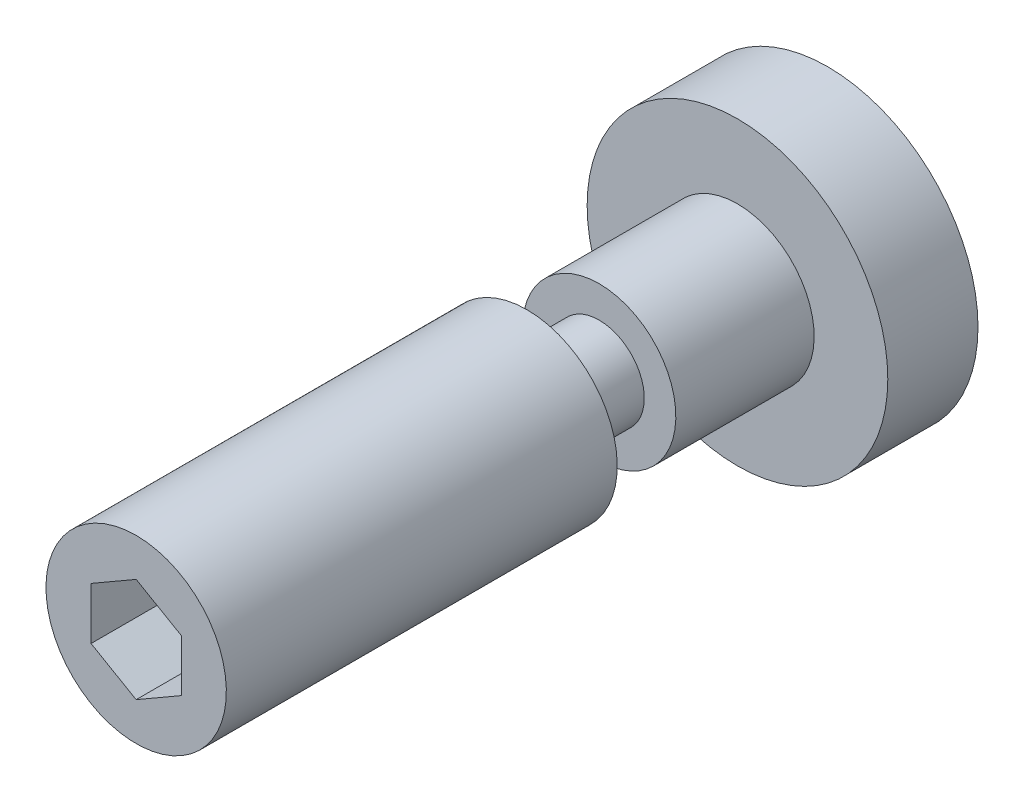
ISO-10303-21;
HEADER;
FILE_DESCRIPTION(('STEP AP214'),'2;1');
FILE_NAME('part.step','',(''),(''),'','','');
FILE_SCHEMA(('AUTOMOTIVE_DESIGN { 1 0 10303 214 1 1 1 1 }'));
ENDSEC;
DATA;
#1=APPLICATION_CONTEXT('core data for automotive mechanical design processes');
#2=APPLICATION_PROTOCOL_DEFINITION('international standard','automotive_design',2000,#1);
#3=PRODUCT_CONTEXT('',#1,'mechanical');
#4=PRODUCT('Part','Part','',(#3));
#5=PRODUCT_RELATED_PRODUCT_CATEGORY('part','',(#4));
#6=PRODUCT_DEFINITION_FORMATION('','',#4);
#7=PRODUCT_DEFINITION_CONTEXT('part definition',#1,'design');
#8=PRODUCT_DEFINITION('design','',#6,#7);
#9=PRODUCT_DEFINITION_SHAPE('','',#8);
#10=(LENGTH_UNIT() NAMED_UNIT(*) SI_UNIT(.MILLI.,.METRE.));
#11=(NAMED_UNIT(*) PLANE_ANGLE_UNIT() SI_UNIT($,.RADIAN.));
#12=(NAMED_UNIT(*) SI_UNIT($,.STERADIAN.) SOLID_ANGLE_UNIT());
#13=UNCERTAINTY_MEASURE_WITH_UNIT(LENGTH_MEASURE(1.E-05),#10,'distance_accuracy_value','');
#14=(GEOMETRIC_REPRESENTATION_CONTEXT(3) GLOBAL_UNCERTAINTY_ASSIGNED_CONTEXT((#13)) GLOBAL_UNIT_ASSIGNED_CONTEXT((#10,
#11,#12)) REPRESENTATION_CONTEXT('',''));
#15=CARTESIAN_POINT('',(0.,0.,0.));
#16=DIRECTION('',(0.,0.,1.));
#17=DIRECTION('',(1.,0.,0.));
#18=AXIS2_PLACEMENT_3D('',#15,#16,#17);
#19=CARTESIAN_POINT('',(0.,0.,0.));
#20=DIRECTION('',(0.,0.,1.));
#21=DIRECTION('',(0.,1.,0.));
#22=AXIS2_PLACEMENT_3D('',#19,#20,#21);
#23=PLANE('',#22);
#24=CARTESIAN_POINT('',(0.,0.,0.));
#25=DIRECTION('',(0.,0.,1.));
#26=DIRECTION('',(0.,1.,0.));
#27=AXIS2_PLACEMENT_3D('',#24,#25,#26);
#28=CIRCLE('',#27,5.);
#29=CARTESIAN_POINT('',(0.,5.,0.));
#30=VERTEX_POINT('',#29);
#31=EDGE_CURVE('E9',#30,#30,#28,.T.);
#32=ORIENTED_EDGE('',*,*,#31,.F.);
#33=EDGE_LOOP('',(#32));
#34=FACE_BOUND('',#33,.T.);
#35=ADVANCED_FACE('F14',(#34),#23,.F.);
#36=CARTESIAN_POINT('',(0.,0.,40.));
#37=DIRECTION('',(0.,0.,1.));
#38=DIRECTION('',(0.,1.,0.));
#39=AXIS2_PLACEMENT_3D('',#36,#37,#38);
#40=CYLINDRICAL_SURFACE('',#39,5.);
#41=CARTESIAN_POINT('',(0.,0.,3.));
#42=DIRECTION('',(0.,0.,1.));
#43=DIRECTION('',(0.,1.,0.));
#44=AXIS2_PLACEMENT_3D('',#41,#42,#43);
#45=CIRCLE('',#44,5.);
#46=CARTESIAN_POINT('',(0.,5.,3.));
#47=VERTEX_POINT('',#46);
#48=EDGE_CURVE('E21',#47,#47,#45,.T.);
#49=ORIENTED_EDGE('',*,*,#48,.F.);
#50=EDGE_LOOP('',(#49));
#51=FACE_BOUND('',#50,.T.);
#52=ORIENTED_EDGE('',*,*,#31,.T.);
#53=EDGE_LOOP('',(#52));
#54=FACE_BOUND('',#53,.T.);
#55=ADVANCED_FACE('F142',(#51,#54),#40,.T.);
#56=CARTESIAN_POINT('',(0.,-5.,3.));
#57=DIRECTION('',(0.,0.,-1.));
#58=DIRECTION('',(0.,-1.,0.));
#59=AXIS2_PLACEMENT_3D('',#56,#57,#58);
#60=PLANE('',#59);
#61=CARTESIAN_POINT('',(0.,0.,3.));
#62=DIRECTION('',(0.,0.,1.));
#63=DIRECTION('',(0.,1.,0.));
#64=AXIS2_PLACEMENT_3D('',#61,#62,#63);
#65=CIRCLE('',#64,2.55);
#66=CARTESIAN_POINT('',(0.,2.55,3.));
#67=VERTEX_POINT('',#66);
#68=EDGE_CURVE('E135',#67,#67,#65,.T.);
#69=ORIENTED_EDGE('',*,*,#68,.F.);
#70=EDGE_LOOP('',(#69));
#71=FACE_BOUND('',#70,.T.);
#72=ORIENTED_EDGE('',*,*,#48,.T.);
#73=EDGE_LOOP('',(#72));
#74=FACE_BOUND('',#73,.T.);
#75=ADVANCED_FACE('F140',(#71,#74),#60,.F.);
#76=CARTESIAN_POINT('',(0.,0.,40.));
#77=DIRECTION('',(0.,0.,1.));
#78=DIRECTION('',(0.,1.,0.));
#79=AXIS2_PLACEMENT_3D('',#76,#77,#78);
#80=CYLINDRICAL_SURFACE('',#79,2.55);
#81=CARTESIAN_POINT('',(0.,0.,7.6));
#82=DIRECTION('',(0.,0.,1.));
#83=DIRECTION('',(0.,1.,0.));
#84=AXIS2_PLACEMENT_3D('',#81,#82,#83);
#85=CIRCLE('',#84,2.55);
#86=CARTESIAN_POINT('',(0.,2.55,7.6));
#87=VERTEX_POINT('',#86);
#88=EDGE_CURVE('E132',#87,#87,#85,.T.);
#89=ORIENTED_EDGE('',*,*,#88,.F.);
#90=EDGE_LOOP('',(#89));
#91=FACE_BOUND('',#90,.T.);
#92=ORIENTED_EDGE('',*,*,#68,.T.);
#93=EDGE_LOOP('',(#92));
#94=FACE_BOUND('',#93,.T.);
#95=ADVANCED_FACE('F165',(#91,#94),#80,.T.);
#96=CARTESIAN_POINT('',(0.,-2.55,7.6));
#97=DIRECTION('',(0.,0.,-1.));
#98=DIRECTION('',(0.,-1.,0.));
#99=AXIS2_PLACEMENT_3D('',#96,#97,#98);
#100=PLANE('',#99);
#101=CARTESIAN_POINT('',(0.,0.,7.6));
#102=DIRECTION('',(0.,0.,1.));
#103=DIRECTION('',(0.,1.,0.));
#104=AXIS2_PLACEMENT_3D('',#101,#102,#103);
#105=CIRCLE('',#104,1.5);
#106=CARTESIAN_POINT('',(0.,1.5,7.6));
#107=VERTEX_POINT('',#106);
#108=EDGE_CURVE('E129',#107,#107,#105,.T.);
#109=ORIENTED_EDGE('',*,*,#108,.F.);
#110=EDGE_LOOP('',(#109));
#111=FACE_BOUND('',#110,.T.);
#112=ORIENTED_EDGE('',*,*,#88,.T.);
#113=EDGE_LOOP('',(#112));
#114=FACE_BOUND('',#113,.T.);
#115=ADVANCED_FACE('F174',(#111,#114),#100,.F.);
#116=CARTESIAN_POINT('',(0.,0.,40.));
#117=DIRECTION('',(0.,0.,1.));
#118=DIRECTION('',(0.,1.,0.));
#119=AXIS2_PLACEMENT_3D('',#116,#117,#118);
#120=CYLINDRICAL_SURFACE('',#119,1.5);
#121=CARTESIAN_POINT('',(0.,0.,10.));
#122=DIRECTION('',(0.,0.,1.));
#123=DIRECTION('',(0.,1.,0.));
#124=AXIS2_PLACEMENT_3D('',#121,#122,#123);
#125=CIRCLE('',#124,1.5);
#126=CARTESIAN_POINT('',(0.,1.5,10.));
#127=VERTEX_POINT('',#126);
#128=EDGE_CURVE('E126',#127,#127,#125,.T.);
#129=ORIENTED_EDGE('',*,*,#128,.F.);
#130=EDGE_LOOP('',(#129));
#131=FACE_BOUND('',#130,.T.);
#132=ORIENTED_EDGE('',*,*,#108,.T.);
#133=EDGE_LOOP('',(#132));
#134=FACE_BOUND('',#133,.T.);
#135=ADVANCED_FACE('F183',(#131,#134),#120,.T.);
#136=CARTESIAN_POINT('',(0.,-1.5,10.));
#137=DIRECTION('',(0.,0.,1.));
#138=DIRECTION('',(0.,1.,0.));
#139=AXIS2_PLACEMENT_3D('',#136,#137,#138);
#140=PLANE('',#139);
#141=CARTESIAN_POINT('',(0.,0.,10.));
#142=DIRECTION('',(0.,0.,1.));
#143=DIRECTION('',(0.,1.,0.));
#144=AXIS2_PLACEMENT_3D('',#141,#142,#143);
#145=CIRCLE('',#144,3.);
#146=CARTESIAN_POINT('',(0.,3.,10.));
#147=VERTEX_POINT('',#146);
#148=EDGE_CURVE('E123',#147,#147,#145,.T.);
#149=ORIENTED_EDGE('',*,*,#148,.F.);
#150=EDGE_LOOP('',(#149));
#151=FACE_BOUND('',#150,.T.);
#152=ORIENTED_EDGE('',*,*,#128,.T.);
#153=EDGE_LOOP('',(#152));
#154=FACE_BOUND('',#153,.T.);
#155=ADVANCED_FACE('F192',(#151,#154),#140,.F.);
#156=CARTESIAN_POINT('',(0.,0.,40.));
#157=DIRECTION('',(0.,0.,1.));
#158=DIRECTION('',(0.,1.,0.));
#159=AXIS2_PLACEMENT_3D('',#156,#157,#158);
#160=CYLINDRICAL_SURFACE('',#159,3.);
#161=CARTESIAN_POINT('',(0.,0.,23.));
#162=DIRECTION('',(0.,0.,1.));
#163=DIRECTION('',(0.,1.,0.));
#164=AXIS2_PLACEMENT_3D('',#161,#162,#163);
#165=CIRCLE('',#164,3.);
#166=CARTESIAN_POINT('',(0.,3.,23.));
#167=VERTEX_POINT('',#166);
#168=EDGE_CURVE('E115',#167,#167,#165,.T.);
#169=ORIENTED_EDGE('',*,*,#168,.F.);
#170=EDGE_LOOP('',(#169));
#171=FACE_BOUND('',#170,.T.);
#172=ORIENTED_EDGE('',*,*,#148,.T.);
#173=EDGE_LOOP('',(#172));
#174=FACE_BOUND('',#173,.T.);
#175=ADVANCED_FACE('F201',(#171,#174),#160,.T.);
#176=CARTESIAN_POINT('',(0.,-3.,23.));
#177=DIRECTION('',(0.,0.,-1.));
#178=DIRECTION('',(0.,-1.,0.));
#179=AXIS2_PLACEMENT_3D('',#176,#177,#178);
#180=PLANE('',#179);
#181=DIRECTION('',(-0.866025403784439,-0.5,0.));
#182=VECTOR('',#181,1.);
#183=CARTESIAN_POINT('',(0.,1.73205080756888,23.));
#184=LINE('',#183,#182);
#185=CARTESIAN_POINT('',(0.,1.73205080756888,23.));
#186=VERTEX_POINT('',#185);
#187=CARTESIAN_POINT('',(-1.5,0.866025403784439,23.));
#188=VERTEX_POINT('',#187);
#189=EDGE_CURVE('E102',#186,#188,#184,.T.);
#190=ORIENTED_EDGE('',*,*,#189,.F.);
#191=DIRECTION('',(-0.866025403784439,0.5,0.));
#192=VECTOR('',#191,1.);
#193=CARTESIAN_POINT('',(1.5,0.86602540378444,23.));
#194=LINE('',#193,#192);
#195=CARTESIAN_POINT('',(1.5,0.86602540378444,23.));
#196=VERTEX_POINT('',#195);
#197=EDGE_CURVE('E28',#196,#186,#194,.T.);
#198=ORIENTED_EDGE('',*,*,#197,.F.);
#199=DIRECTION('',(0.,1.,0.));
#200=VECTOR('',#199,1.);
#201=CARTESIAN_POINT('',(1.5,-0.866025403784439,23.));
#202=LINE('',#201,#200);
#203=CARTESIAN_POINT('',(1.5,-0.866025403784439,23.));
#204=VERTEX_POINT('',#203);
#205=EDGE_CURVE('E111',#204,#196,#202,.T.);
#206=ORIENTED_EDGE('',*,*,#205,.F.);
#207=DIRECTION('',(0.866025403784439,0.5,0.));
#208=VECTOR('',#207,1.);
#209=CARTESIAN_POINT('',(0.,-1.73205080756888,23.));
#210=LINE('',#209,#208);
#211=CARTESIAN_POINT('',(0.,-1.73205080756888,23.));
#212=VERTEX_POINT('',#211);
#213=EDGE_CURVE('E109',#212,#204,#210,.T.);
#214=ORIENTED_EDGE('',*,*,#213,.F.);
#215=DIRECTION('',(0.866025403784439,-0.5,0.));
#216=VECTOR('',#215,1.);
#217=CARTESIAN_POINT('',(-1.5,-0.866025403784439,23.));
#218=LINE('',#217,#216);
#219=CARTESIAN_POINT('',(-1.5,-0.866025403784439,23.));
#220=VERTEX_POINT('',#219);
#221=EDGE_CURVE('E76',#220,#212,#218,.T.);
#222=ORIENTED_EDGE('',*,*,#221,.F.);
#223=DIRECTION('',(0.,-1.,0.));
#224=VECTOR('',#223,1.);
#225=CARTESIAN_POINT('',(-1.5,0.866025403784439,23.));
#226=LINE('',#225,#224);
#227=EDGE_CURVE('E105',#188,#220,#226,.T.);
#228=ORIENTED_EDGE('',*,*,#227,.F.);
#229=EDGE_LOOP('',(#190,#198,#206,#214,#222,#228));
#230=FACE_BOUND('',#229,.T.);
#231=ORIENTED_EDGE('',*,*,#168,.T.);
#232=EDGE_LOOP('',(#231));
#233=FACE_BOUND('',#232,.T.);
#234=ADVANCED_FACE('F210',(#230,#233),#180,.F.);
#235=CARTESIAN_POINT('',(1.5,0.86602540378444,19.));
#236=DIRECTION('',(0.5,0.866025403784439,0.));
#237=DIRECTION('',(-0.866025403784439,0.5,0.));
#238=AXIS2_PLACEMENT_3D('',#235,#236,#237);
#239=PLANE('',#238);
#240=ORIENTED_EDGE('',*,*,#197,.T.);
#241=DIRECTION('',(0.,0.,1.));
#242=VECTOR('',#241,1.);
#243=CARTESIAN_POINT('',(0.,1.73205080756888,19.));
#244=LINE('',#243,#242);
#245=CARTESIAN_POINT('',(0.,1.73205080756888,19.));
#246=VERTEX_POINT('',#245);
#247=EDGE_CURVE('E58',#246,#186,#244,.T.);
#248=ORIENTED_EDGE('',*,*,#247,.F.);
#249=DIRECTION('',(-0.866025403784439,0.5,0.));
#250=VECTOR('',#249,1.);
#251=CARTESIAN_POINT('',(1.5,0.86602540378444,19.));
#252=LINE('',#251,#250);
#253=CARTESIAN_POINT('',(1.5,0.86602540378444,19.));
#254=VERTEX_POINT('',#253);
#255=EDGE_CURVE('E113',#254,#246,#252,.T.);
#256=ORIENTED_EDGE('',*,*,#255,.F.);
#257=DIRECTION('',(0.,0.,1.));
#258=VECTOR('',#257,1.);
#259=CARTESIAN_POINT('',(1.5,0.86602540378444,19.));
#260=LINE('',#259,#258);
#261=EDGE_CURVE('E36',#254,#196,#260,.T.);
#262=ORIENTED_EDGE('',*,*,#261,.T.);
#263=EDGE_LOOP('',(#240,#248,#256,#262));
#264=FACE_BOUND('',#263,.T.);
#265=ADVANCED_FACE('F219',(#264),#239,.F.);
#266=CARTESIAN_POINT('',(1.5,-0.866025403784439,19.));
#267=DIRECTION('',(1.,0.,0.));
#268=DIRECTION('',(0.,0.,-1.));
#269=AXIS2_PLACEMENT_3D('',#266,#267,#268);
#270=PLANE('',#269);
#271=ORIENTED_EDGE('',*,*,#205,.T.);
#272=ORIENTED_EDGE('',*,*,#261,.F.);
#273=DIRECTION('',(0.,1.,0.));
#274=VECTOR('',#273,1.);
#275=CARTESIAN_POINT('',(1.5,-0.866025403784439,19.));
#276=LINE('',#275,#274);
#277=CARTESIAN_POINT('',(1.5,-0.866025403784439,19.));
#278=VERTEX_POINT('',#277);
#279=EDGE_CURVE('E88',#278,#254,#276,.T.);
#280=ORIENTED_EDGE('',*,*,#279,.F.);
#281=DIRECTION('',(0.,0.,1.));
#282=VECTOR('',#281,1.);
#283=CARTESIAN_POINT('',(1.5,-0.866025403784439,19.));
#284=LINE('',#283,#282);
#285=EDGE_CURVE('E80',#278,#204,#284,.T.);
#286=ORIENTED_EDGE('',*,*,#285,.T.);
#287=EDGE_LOOP('',(#271,#272,#280,#286));
#288=FACE_BOUND('',#287,.T.);
#289=ADVANCED_FACE('F228',(#288),#270,.F.);
#290=CARTESIAN_POINT('',(0.,-1.73205080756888,19.));
#291=DIRECTION('',(0.5,-0.866025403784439,0.));
#292=DIRECTION('',(0.866025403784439,0.5,0.));
#293=AXIS2_PLACEMENT_3D('',#290,#291,#292);
#294=PLANE('',#293);
#295=ORIENTED_EDGE('',*,*,#213,.T.);
#296=ORIENTED_EDGE('',*,*,#285,.F.);
#297=DIRECTION('',(0.866025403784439,0.5,0.));
#298=VECTOR('',#297,1.);
#299=CARTESIAN_POINT('',(0.,-1.73205080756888,19.));
#300=LINE('',#299,#298);
#301=CARTESIAN_POINT('',(0.,-1.73205080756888,19.));
#302=VERTEX_POINT('',#301);
#303=EDGE_CURVE('E84',#302,#278,#300,.T.);
#304=ORIENTED_EDGE('',*,*,#303,.F.);
#305=DIRECTION('',(0.,0.,1.));
#306=VECTOR('',#305,1.);
#307=CARTESIAN_POINT('',(0.,-1.73205080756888,19.));
#308=LINE('',#307,#306);
#309=EDGE_CURVE('E69',#302,#212,#308,.T.);
#310=ORIENTED_EDGE('',*,*,#309,.T.);
#311=EDGE_LOOP('',(#295,#296,#304,#310));
#312=FACE_BOUND('',#311,.T.);
#313=ADVANCED_FACE('F85',(#312),#294,.F.);
#314=CARTESIAN_POINT('',(-1.5,-0.866025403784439,19.));
#315=DIRECTION('',(-0.5,-0.866025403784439,0.));
#316=DIRECTION('',(0.866025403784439,-0.5,0.));
#317=AXIS2_PLACEMENT_3D('',#314,#315,#316);
#318=PLANE('',#317);
#319=ORIENTED_EDGE('',*,*,#221,.T.);
#320=ORIENTED_EDGE('',*,*,#309,.F.);
#321=DIRECTION('',(0.866025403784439,-0.5,0.));
#322=VECTOR('',#321,1.);
#323=CARTESIAN_POINT('',(-1.5,-0.866025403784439,19.));
#324=LINE('',#323,#322);
#325=CARTESIAN_POINT('',(-1.5,-0.866025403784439,19.));
#326=VERTEX_POINT('',#325);
#327=EDGE_CURVE('E73',#326,#302,#324,.T.);
#328=ORIENTED_EDGE('',*,*,#327,.F.);
#329=DIRECTION('',(0.,0.,1.));
#330=VECTOR('',#329,1.);
#331=CARTESIAN_POINT('',(-1.5,-0.866025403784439,19.));
#332=LINE('',#331,#330);
#333=EDGE_CURVE('E81',#326,#220,#332,.T.);
#334=ORIENTED_EDGE('',*,*,#333,.T.);
#335=EDGE_LOOP('',(#319,#320,#328,#334));
#336=FACE_BOUND('',#335,.T.);
#337=ADVANCED_FACE('F71',(#336),#318,.F.);
#338=CARTESIAN_POINT('',(-1.5,0.866025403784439,19.));
#339=DIRECTION('',(-1.,0.,0.));
#340=DIRECTION('',(0.,-1.,0.));
#341=AXIS2_PLACEMENT_3D('',#338,#339,#340);
#342=PLANE('',#341);
#343=ORIENTED_EDGE('',*,*,#227,.T.);
#344=ORIENTED_EDGE('',*,*,#333,.F.);
#345=DIRECTION('',(0.,-1.,0.));
#346=VECTOR('',#345,1.);
#347=CARTESIAN_POINT('',(-1.5,0.866025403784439,19.));
#348=LINE('',#347,#346);
#349=CARTESIAN_POINT('',(-1.5,0.866025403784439,19.));
#350=VERTEX_POINT('',#349);
#351=EDGE_CURVE('E94',#350,#326,#348,.T.);
#352=ORIENTED_EDGE('',*,*,#351,.F.);
#353=DIRECTION('',(0.,0.,1.));
#354=VECTOR('',#353,1.);
#355=CARTESIAN_POINT('',(-1.5,0.866025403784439,19.));
#356=LINE('',#355,#354);
#357=EDGE_CURVE('E118',#350,#188,#356,.T.);
#358=ORIENTED_EDGE('',*,*,#357,.T.);
#359=EDGE_LOOP('',(#343,#344,#352,#358));
#360=FACE_BOUND('',#359,.T.);
#361=ADVANCED_FACE('F250',(#360),#342,.F.);
#362=CARTESIAN_POINT('',(0.,1.73205080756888,19.));
#363=DIRECTION('',(-0.5,0.866025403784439,0.));
#364=DIRECTION('',(-0.866025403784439,-0.5,0.));
#365=AXIS2_PLACEMENT_3D('',#362,#363,#364);
#366=PLANE('',#365);
#367=ORIENTED_EDGE('',*,*,#189,.T.);
#368=ORIENTED_EDGE('',*,*,#357,.F.);
#369=DIRECTION('',(-0.866025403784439,-0.5,0.));
#370=VECTOR('',#369,1.);
#371=CARTESIAN_POINT('',(0.,1.73205080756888,19.));
#372=LINE('',#371,#370);
#373=EDGE_CURVE('E96',#246,#350,#372,.T.);
#374=ORIENTED_EDGE('',*,*,#373,.F.);
#375=ORIENTED_EDGE('',*,*,#247,.T.);
#376=EDGE_LOOP('',(#367,#368,#374,#375));
#377=FACE_BOUND('',#376,.T.);
#378=ADVANCED_FACE('F258',(#377),#366,.F.);
#379=CARTESIAN_POINT('',(0.,1.73205080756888,19.));
#380=DIRECTION('',(0.,0.,1.));
#381=DIRECTION('',(1.,0.,0.));
#382=AXIS2_PLACEMENT_3D('',#379,#380,#381);
#383=PLANE('',#382);
#384=ORIENTED_EDGE('',*,*,#255,.T.);
#385=ORIENTED_EDGE('',*,*,#373,.T.);
#386=ORIENTED_EDGE('',*,*,#351,.T.);
#387=ORIENTED_EDGE('',*,*,#327,.T.);
#388=ORIENTED_EDGE('',*,*,#303,.T.);
#389=ORIENTED_EDGE('',*,*,#279,.T.);
#390=EDGE_LOOP('',(#384,#385,#386,#387,#388,#389));
#391=FACE_BOUND('',#390,.T.);
#392=ADVANCED_FACE('F91',(#391),#383,.T.);
#393=CLOSED_SHELL('',(#35,#55,#75,#95,#115,#135,#155,#175,#234,#265,#289,#313,#337,#361,#378,#392));
#394=MANIFOLD_SOLID_BREP('B1',#393);
#395=ADVANCED_BREP_SHAPE_REPRESENTATION('',(#18,#394),#14);
#396=SHAPE_DEFINITION_REPRESENTATION(#9,#395);
ENDSEC;
END-ISO-10303-21;
